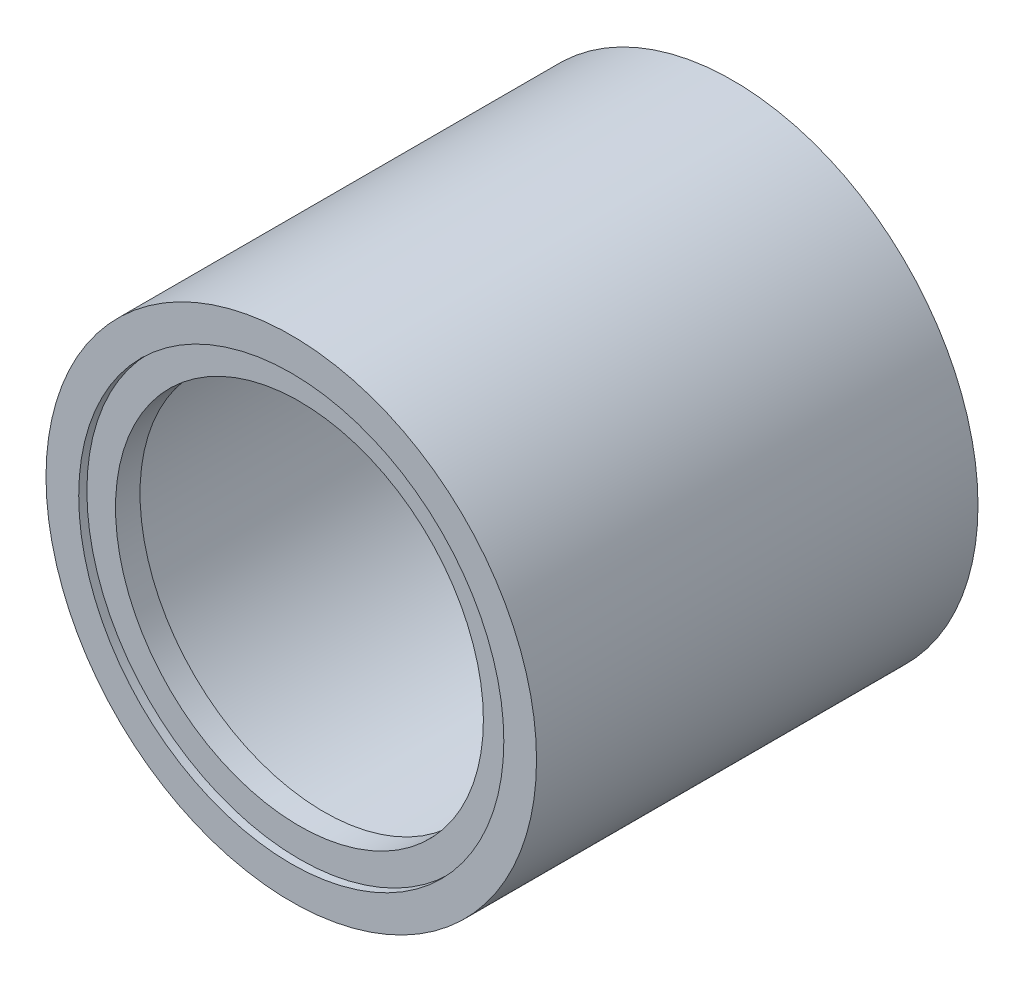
ISO-10303-21;
HEADER;
FILE_DESCRIPTION(('STEP AP214'),'2;1');
FILE_NAME('part.step','',(''),(''),'','','');
FILE_SCHEMA(('AUTOMOTIVE_DESIGN { 1 0 10303 214 1 1 1 1 }'));
ENDSEC;
DATA;
#1=APPLICATION_CONTEXT('core data for automotive mechanical design processes');
#2=APPLICATION_PROTOCOL_DEFINITION('international standard','automotive_design',2000,#1);
#3=PRODUCT_CONTEXT('',#1,'mechanical');
#4=PRODUCT('Part','Part','',(#3));
#5=PRODUCT_RELATED_PRODUCT_CATEGORY('part','',(#4));
#6=PRODUCT_DEFINITION_FORMATION('','',#4);
#7=PRODUCT_DEFINITION_CONTEXT('part definition',#1,'design');
#8=PRODUCT_DEFINITION('design','',#6,#7);
#9=PRODUCT_DEFINITION_SHAPE('','',#8);
#10=(LENGTH_UNIT() NAMED_UNIT(*) SI_UNIT(.MILLI.,.METRE.));
#11=(NAMED_UNIT(*) PLANE_ANGLE_UNIT() SI_UNIT($,.RADIAN.));
#12=(NAMED_UNIT(*) SI_UNIT($,.STERADIAN.) SOLID_ANGLE_UNIT());
#13=UNCERTAINTY_MEASURE_WITH_UNIT(LENGTH_MEASURE(1.E-05),#10,'distance_accuracy_value','');
#14=(GEOMETRIC_REPRESENTATION_CONTEXT(3) GLOBAL_UNCERTAINTY_ASSIGNED_CONTEXT((#13)) GLOBAL_UNIT_ASSIGNED_CONTEXT((#10,
#11,#12)) REPRESENTATION_CONTEXT('',''));
#15=CARTESIAN_POINT('',(0.,0.,0.));
#16=DIRECTION('',(0.,0.,1.));
#17=DIRECTION('',(1.,0.,0.));
#18=AXIS2_PLACEMENT_3D('',#15,#16,#17);
#19=CARTESIAN_POINT('',(0.,15.,27.));
#20=DIRECTION('',(0.,0.,-1.));
#21=DIRECTION('',(-1.,0.,0.));
#22=AXIS2_PLACEMENT_3D('',#19,#20,#21);
#23=PLANE('',#22);
#24=CARTESIAN_POINT('',(0.,0.,27.));
#25=DIRECTION('',(0.,0.,1.));
#26=DIRECTION('',(1.,0.,0.));
#27=AXIS2_PLACEMENT_3D('',#24,#25,#26);
#28=CIRCLE('',#27,13.);
#29=CARTESIAN_POINT('',(13.,0.,27.));
#30=VERTEX_POINT('',#29);
#31=EDGE_CURVE('E8',#30,#30,#28,.T.);
#32=ORIENTED_EDGE('',*,*,#31,.F.);
#33=EDGE_LOOP('',(#32));
#34=FACE_BOUND('',#33,.T.);
#35=CARTESIAN_POINT('',(0.,0.,27.));
#36=DIRECTION('',(0.,0.,1.));
#37=DIRECTION('',(1.,0.,0.));
#38=AXIS2_PLACEMENT_3D('',#35,#36,#37);
#39=CIRCLE('',#38,15.);
#40=CARTESIAN_POINT('',(15.,0.,27.));
#41=VERTEX_POINT('',#40);
#42=EDGE_CURVE('E40',#41,#41,#39,.T.);
#43=ORIENTED_EDGE('',*,*,#42,.T.);
#44=EDGE_LOOP('',(#43));
#45=FACE_BOUND('',#44,.T.);
#46=ADVANCED_FACE('F12',(#34,#45),#23,.F.);
#47=CARTESIAN_POINT('',(0.,0.,27.));
#48=DIRECTION('',(0.,0.,1.));
#49=DIRECTION('',(1.,0.,0.));
#50=AXIS2_PLACEMENT_3D('',#47,#48,#49);
#51=CYLINDRICAL_SURFACE('',#50,13.);
#52=CARTESIAN_POINT('',(0.,0.,26.5));
#53=DIRECTION('',(0.,0.,1.));
#54=DIRECTION('',(1.,0.,0.));
#55=AXIS2_PLACEMENT_3D('',#52,#53,#54);
#56=CIRCLE('',#55,13.);
#57=CARTESIAN_POINT('',(13.,0.,26.5));
#58=VERTEX_POINT('',#57);
#59=EDGE_CURVE('E18',#58,#58,#56,.T.);
#60=ORIENTED_EDGE('',*,*,#59,.F.);
#61=EDGE_LOOP('',(#60));
#62=FACE_BOUND('',#61,.T.);
#63=ORIENTED_EDGE('',*,*,#31,.T.);
#64=EDGE_LOOP('',(#63));
#65=FACE_BOUND('',#64,.T.);
#66=ADVANCED_FACE('F77',(#62,#65),#51,.F.);
#67=CARTESIAN_POINT('',(0.,13.,26.5));
#68=DIRECTION('',(0.,0.,-1.));
#69=DIRECTION('',(-1.,0.,0.));
#70=AXIS2_PLACEMENT_3D('',#67,#68,#69);
#71=PLANE('',#70);
#72=CARTESIAN_POINT('',(0.,0.,26.5));
#73=DIRECTION('',(0.,0.,1.));
#74=DIRECTION('',(1.,0.,0.));
#75=AXIS2_PLACEMENT_3D('',#72,#73,#74);
#76=CIRCLE('',#75,11.25);
#77=CARTESIAN_POINT('',(11.25,0.,26.5));
#78=VERTEX_POINT('',#77);
#79=EDGE_CURVE('E22',#78,#78,#76,.T.);
#80=ORIENTED_EDGE('',*,*,#79,.F.);
#81=EDGE_LOOP('',(#80));
#82=FACE_BOUND('',#81,.T.);
#83=ORIENTED_EDGE('',*,*,#59,.T.);
#84=EDGE_LOOP('',(#83));
#85=FACE_BOUND('',#84,.T.);
#86=ADVANCED_FACE('F72',(#82,#85),#71,.F.);
#87=CARTESIAN_POINT('',(0.,0.,27.));
#88=DIRECTION('',(0.,0.,1.));
#89=DIRECTION('',(1.,0.,0.));
#90=AXIS2_PLACEMENT_3D('',#87,#88,#89);
#91=CYLINDRICAL_SURFACE('',#90,11.25);
#92=CARTESIAN_POINT('',(0.,0.,25.));
#93=DIRECTION('',(0.,0.,1.));
#94=DIRECTION('',(1.,0.,0.));
#95=AXIS2_PLACEMENT_3D('',#92,#93,#94);
#96=CIRCLE('',#95,11.25);
#97=CARTESIAN_POINT('',(11.25,0.,25.));
#98=VERTEX_POINT('',#97);
#99=EDGE_CURVE('E26',#98,#98,#96,.T.);
#100=ORIENTED_EDGE('',*,*,#99,.F.);
#101=EDGE_LOOP('',(#100));
#102=FACE_BOUND('',#101,.T.);
#103=ORIENTED_EDGE('',*,*,#79,.T.);
#104=EDGE_LOOP('',(#103));
#105=FACE_BOUND('',#104,.T.);
#106=ADVANCED_FACE('F66',(#102,#105),#91,.F.);
#107=CARTESIAN_POINT('',(0.,11.25,25.));
#108=DIRECTION('',(0.,0.,1.));
#109=DIRECTION('',(1.,0.,0.));
#110=AXIS2_PLACEMENT_3D('',#107,#108,#109);
#111=PLANE('',#110);
#112=CARTESIAN_POINT('',(0.,0.,25.));
#113=DIRECTION('',(0.,0.,1.));
#114=DIRECTION('',(1.,0.,0.));
#115=AXIS2_PLACEMENT_3D('',#112,#113,#114);
#116=CIRCLE('',#115,13.5);
#117=CARTESIAN_POINT('',(13.5,0.,25.));
#118=VERTEX_POINT('',#117);
#119=EDGE_CURVE('E31',#118,#118,#116,.T.);
#120=ORIENTED_EDGE('',*,*,#119,.F.);
#121=EDGE_LOOP('',(#120));
#122=FACE_BOUND('',#121,.T.);
#123=ORIENTED_EDGE('',*,*,#99,.T.);
#124=EDGE_LOOP('',(#123));
#125=FACE_BOUND('',#124,.T.);
#126=ADVANCED_FACE('F60',(#122,#125),#111,.F.);
#127=CARTESIAN_POINT('',(0.,0.,27.));
#128=DIRECTION('',(0.,0.,1.));
#129=DIRECTION('',(1.,0.,0.));
#130=AXIS2_PLACEMENT_3D('',#127,#128,#129);
#131=CYLINDRICAL_SURFACE('',#130,13.5);
#132=CARTESIAN_POINT('',(0.,0.,0.));
#133=DIRECTION('',(0.,0.,1.));
#134=DIRECTION('',(1.,0.,0.));
#135=AXIS2_PLACEMENT_3D('',#132,#133,#134);
#136=CIRCLE('',#135,13.5);
#137=CARTESIAN_POINT('',(13.5,0.,0.));
#138=VERTEX_POINT('',#137);
#139=EDGE_CURVE('E34',#138,#138,#136,.T.);
#140=ORIENTED_EDGE('',*,*,#139,.F.);
#141=EDGE_LOOP('',(#140));
#142=FACE_BOUND('',#141,.T.);
#143=ORIENTED_EDGE('',*,*,#119,.T.);
#144=EDGE_LOOP('',(#143));
#145=FACE_BOUND('',#144,.T.);
#146=ADVANCED_FACE('F54',(#142,#145),#131,.F.);
#147=CARTESIAN_POINT('',(0.,15.,0.));
#148=DIRECTION('',(0.,0.,1.));
#149=DIRECTION('',(1.,0.,0.));
#150=AXIS2_PLACEMENT_3D('',#147,#148,#149);
#151=PLANE('',#150);
#152=CARTESIAN_POINT('',(0.,0.,0.));
#153=DIRECTION('',(0.,0.,1.));
#154=DIRECTION('',(1.,0.,0.));
#155=AXIS2_PLACEMENT_3D('',#152,#153,#154);
#156=CIRCLE('',#155,15.);
#157=CARTESIAN_POINT('',(15.,0.,0.));
#158=VERTEX_POINT('',#157);
#159=EDGE_CURVE('E37',#158,#158,#156,.T.);
#160=ORIENTED_EDGE('',*,*,#159,.F.);
#161=EDGE_LOOP('',(#160));
#162=FACE_BOUND('',#161,.T.);
#163=ORIENTED_EDGE('',*,*,#139,.T.);
#164=EDGE_LOOP('',(#163));
#165=FACE_BOUND('',#164,.T.);
#166=ADVANCED_FACE('F48',(#162,#165),#151,.F.);
#167=CARTESIAN_POINT('',(0.,0.,27.));
#168=DIRECTION('',(0.,0.,1.));
#169=DIRECTION('',(1.,0.,0.));
#170=AXIS2_PLACEMENT_3D('',#167,#168,#169);
#171=CYLINDRICAL_SURFACE('',#170,15.);
#172=ORIENTED_EDGE('',*,*,#42,.F.);
#173=EDGE_LOOP('',(#172));
#174=FACE_BOUND('',#173,.T.);
#175=ORIENTED_EDGE('',*,*,#159,.T.);
#176=EDGE_LOOP('',(#175));
#177=FACE_BOUND('',#176,.T.);
#178=ADVANCED_FACE('F45',(#174,#177),#171,.T.);
#179=CLOSED_SHELL('',(#46,#66,#86,#106,#126,#146,#166,#178));
#180=MANIFOLD_SOLID_BREP('B1',#179);
#181=ADVANCED_BREP_SHAPE_REPRESENTATION('',(#18,#180),#14);
#182=SHAPE_DEFINITION_REPRESENTATION(#9,#181);
ENDSEC;
END-ISO-10303-21;
